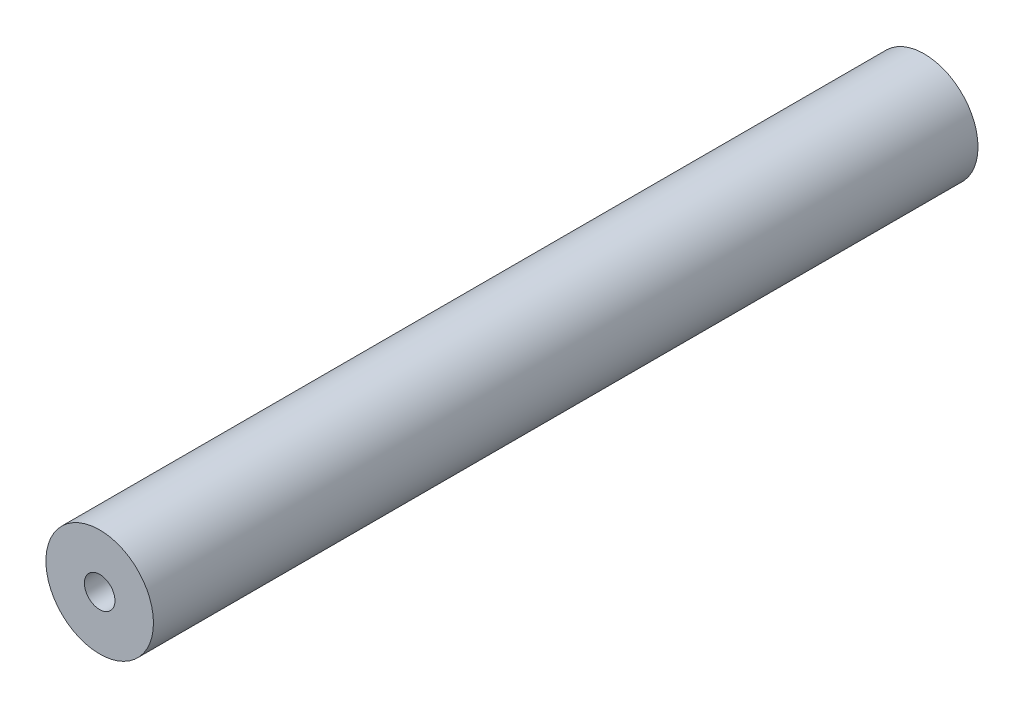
ISO-10303-21;
HEADER;
FILE_DESCRIPTION(('STEP AP214'),'2;1');
FILE_NAME('part.step','',(''),(''),'','','');
FILE_SCHEMA(('AUTOMOTIVE_DESIGN { 1 0 10303 214 1 1 1 1 }'));
ENDSEC;
DATA;
#1=APPLICATION_CONTEXT('core data for automotive mechanical design processes');
#2=APPLICATION_PROTOCOL_DEFINITION('international standard','automotive_design',2000,#1);
#3=PRODUCT_CONTEXT('',#1,'mechanical');
#4=PRODUCT('Part','Part','',(#3));
#5=PRODUCT_RELATED_PRODUCT_CATEGORY('part','',(#4));
#6=PRODUCT_DEFINITION_FORMATION('','',#4);
#7=PRODUCT_DEFINITION_CONTEXT('part definition',#1,'design');
#8=PRODUCT_DEFINITION('design','',#6,#7);
#9=PRODUCT_DEFINITION_SHAPE('','',#8);
#10=(LENGTH_UNIT() NAMED_UNIT(*) SI_UNIT(.MILLI.,.METRE.));
#11=(NAMED_UNIT(*) PLANE_ANGLE_UNIT() SI_UNIT($,.RADIAN.));
#12=(NAMED_UNIT(*) SI_UNIT($,.STERADIAN.) SOLID_ANGLE_UNIT());
#13=UNCERTAINTY_MEASURE_WITH_UNIT(LENGTH_MEASURE(1.E-05),#10,'distance_accuracy_value','');
#14=(GEOMETRIC_REPRESENTATION_CONTEXT(3) GLOBAL_UNCERTAINTY_ASSIGNED_CONTEXT((#13)) GLOBAL_UNIT_ASSIGNED_CONTEXT((#10,
#11,#12)) REPRESENTATION_CONTEXT('',''));
#15=CARTESIAN_POINT('',(0.,0.,0.));
#16=DIRECTION('',(0.,0.,1.));
#17=DIRECTION('',(1.,0.,0.));
#18=AXIS2_PLACEMENT_3D('',#15,#16,#17);
#19=CARTESIAN_POINT('',(0.,0.,73.025));
#20=DIRECTION('',(0.,0.,-1.));
#21=DIRECTION('',(-1.,0.,0.));
#22=AXIS2_PLACEMENT_3D('',#19,#20,#21);
#23=CYLINDRICAL_SURFACE('',#22,9.525);
#24=CARTESIAN_POINT('',(0.,0.,73.025));
#25=DIRECTION('',(0.,0.,1.));
#26=DIRECTION('',(1.,0.,0.));
#27=AXIS2_PLACEMENT_3D('',#24,#25,#26);
#28=CIRCLE('',#27,9.525);
#29=CARTESIAN_POINT('',(9.525,0.,73.025));
#30=VERTEX_POINT('',#29);
#31=EDGE_CURVE('E11',#30,#30,#28,.T.);
#32=ORIENTED_EDGE('',*,*,#31,.F.);
#33=EDGE_LOOP('',(#32));
#34=FACE_BOUND('',#33,.T.);
#35=CARTESIAN_POINT('',(0.,0.,-73.025));
#36=DIRECTION('',(0.,0.,1.));
#37=DIRECTION('',(1.,0.,0.));
#38=AXIS2_PLACEMENT_3D('',#35,#36,#37);
#39=CIRCLE('',#38,9.525);
#40=CARTESIAN_POINT('',(9.525,0.,-73.025));
#41=VERTEX_POINT('',#40);
#42=EDGE_CURVE('E41',#41,#41,#39,.T.);
#43=ORIENTED_EDGE('',*,*,#42,.T.);
#44=EDGE_LOOP('',(#43));
#45=FACE_BOUND('',#44,.T.);
#46=ADVANCED_FACE('F38',(#34,#45),#23,.T.);
#47=CARTESIAN_POINT('',(0.,0.,73.025));
#48=DIRECTION('',(0.,0.,1.));
#49=DIRECTION('',(1.,0.,0.));
#50=AXIS2_PLACEMENT_3D('',#47,#48,#49);
#51=PLANE('',#50);
#52=CARTESIAN_POINT('',(0.,0.,73.025));
#53=DIRECTION('',(0.,0.,1.));
#54=DIRECTION('',(1.,0.,0.));
#55=AXIS2_PLACEMENT_3D('',#52,#53,#54);
#56=CIRCLE('',#55,2.70509999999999);
#57=CARTESIAN_POINT('',(2.70509999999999,0.,73.025));
#58=VERTEX_POINT('',#57);
#59=EDGE_CURVE('E61',#58,#58,#56,.T.);
#60=ORIENTED_EDGE('',*,*,#59,.F.);
#61=EDGE_LOOP('',(#60));
#62=FACE_BOUND('',#61,.T.);
#63=ORIENTED_EDGE('',*,*,#31,.T.);
#64=EDGE_LOOP('',(#63));
#65=FACE_BOUND('',#64,.T.);
#66=ADVANCED_FACE('F80',(#62,#65),#51,.T.);
#67=CARTESIAN_POINT('',(0.,0.,-73.025));
#68=DIRECTION('',(0.,0.,1.));
#69=DIRECTION('',(1.,0.,0.));
#70=AXIS2_PLACEMENT_3D('',#67,#68,#69);
#71=PLANE('',#70);
#72=CARTESIAN_POINT('',(0.,0.,-73.025));
#73=DIRECTION('',(0.,0.,-1.));
#74=DIRECTION('',(-1.,0.,0.));
#75=AXIS2_PLACEMENT_3D('',#72,#73,#74);
#76=CIRCLE('',#75,2.70509999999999);
#77=CARTESIAN_POINT('',(-2.70509999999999,0.,-73.025));
#78=VERTEX_POINT('',#77);
#79=EDGE_CURVE('E62',#78,#78,#76,.T.);
#80=ORIENTED_EDGE('',*,*,#79,.F.);
#81=EDGE_LOOP('',(#80));
#82=FACE_BOUND('',#81,.T.);
#83=ORIENTED_EDGE('',*,*,#42,.F.);
#84=EDGE_LOOP('',(#83));
#85=FACE_BOUND('',#84,.T.);
#86=ADVANCED_FACE('F77',(#82,#85),#71,.F.);
#87=CARTESIAN_POINT('',(0.,0.,49.4284));
#88=DIRECTION('',(0.,0.,1.));
#89=DIRECTION('',(1.,0.,0.));
#90=AXIS2_PLACEMENT_3D('',#87,#88,#89);
#91=CONICAL_SURFACE('',#90,2.70509999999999,1.02974425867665);
#92=CARTESIAN_POINT('',(0.,0.,47.8030119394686));
#93=VERTEX_POINT('',#92);
#94=VERTEX_LOOP('',#93);
#95=FACE_BOUND('',#94,.T.);
#96=CARTESIAN_POINT('',(0.,0.,49.4284));
#97=DIRECTION('',(0.,0.,1.));
#98=DIRECTION('',(1.,0.,0.));
#99=AXIS2_PLACEMENT_3D('',#96,#97,#98);
#100=CIRCLE('',#99,2.70509999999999);
#101=CARTESIAN_POINT('',(2.70509999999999,0.,49.4284));
#102=VERTEX_POINT('',#101);
#103=EDGE_CURVE('E65',#102,#102,#100,.T.);
#104=ORIENTED_EDGE('',*,*,#103,.T.);
#105=EDGE_LOOP('',(#104));
#106=FACE_BOUND('',#105,.T.);
#107=ADVANCED_FACE('F79',(#95,#106),#91,.F.);
#108=CARTESIAN_POINT('',(0.,0.,73.025));
#109=DIRECTION('',(0.,0.,1.));
#110=DIRECTION('',(1.,0.,0.));
#111=AXIS2_PLACEMENT_3D('',#108,#109,#110);
#112=CYLINDRICAL_SURFACE('',#111,2.70509999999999);
#113=ORIENTED_EDGE('',*,*,#103,.F.);
#114=EDGE_LOOP('',(#113));
#115=FACE_BOUND('',#114,.T.);
#116=ORIENTED_EDGE('',*,*,#59,.T.);
#117=EDGE_LOOP('',(#116));
#118=FACE_BOUND('',#117,.T.);
#119=ADVANCED_FACE('F55',(#115,#118),#112,.F.);
#120=CARTESIAN_POINT('',(0.,0.,-49.4284));
#121=DIRECTION('',(0.,0.,-1.));
#122=DIRECTION('',(-1.,0.,0.));
#123=AXIS2_PLACEMENT_3D('',#120,#121,#122);
#124=CONICAL_SURFACE('',#123,2.70509999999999,1.02974425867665);
#125=CARTESIAN_POINT('',(0.,0.,-47.8030119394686));
#126=VERTEX_POINT('',#125);
#127=VERTEX_LOOP('',#126);
#128=FACE_BOUND('',#127,.T.);
#129=CARTESIAN_POINT('',(0.,0.,-49.4284));
#130=DIRECTION('',(0.,0.,-1.));
#131=DIRECTION('',(-1.,0.,0.));
#132=AXIS2_PLACEMENT_3D('',#129,#130,#131);
#133=CIRCLE('',#132,2.70509999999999);
#134=CARTESIAN_POINT('',(-2.70509999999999,0.,-49.4284));
#135=VERTEX_POINT('',#134);
#136=EDGE_CURVE('E59',#135,#135,#133,.T.);
#137=ORIENTED_EDGE('',*,*,#136,.T.);
#138=EDGE_LOOP('',(#137));
#139=FACE_BOUND('',#138,.T.);
#140=ADVANCED_FACE('F51',(#128,#139),#124,.F.);
#141=CARTESIAN_POINT('',(0.,0.,-73.025));
#142=DIRECTION('',(0.,0.,-1.));
#143=DIRECTION('',(-1.,0.,0.));
#144=AXIS2_PLACEMENT_3D('',#141,#142,#143);
#145=CYLINDRICAL_SURFACE('',#144,2.70509999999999);
#146=ORIENTED_EDGE('',*,*,#136,.F.);
#147=EDGE_LOOP('',(#146));
#148=FACE_BOUND('',#147,.T.);
#149=ORIENTED_EDGE('',*,*,#79,.T.);
#150=EDGE_LOOP('',(#149));
#151=FACE_BOUND('',#150,.T.);
#152=ADVANCED_FACE('F54',(#148,#151),#145,.F.);
#153=CLOSED_SHELL('',(#46,#66,#86,#107,#119,#140,#152));
#154=MANIFOLD_SOLID_BREP('B2',#153);
#155=ADVANCED_BREP_SHAPE_REPRESENTATION('',(#18,#154),#14);
#156=SHAPE_DEFINITION_REPRESENTATION(#9,#155);
ENDSEC;
END-ISO-10303-21;
